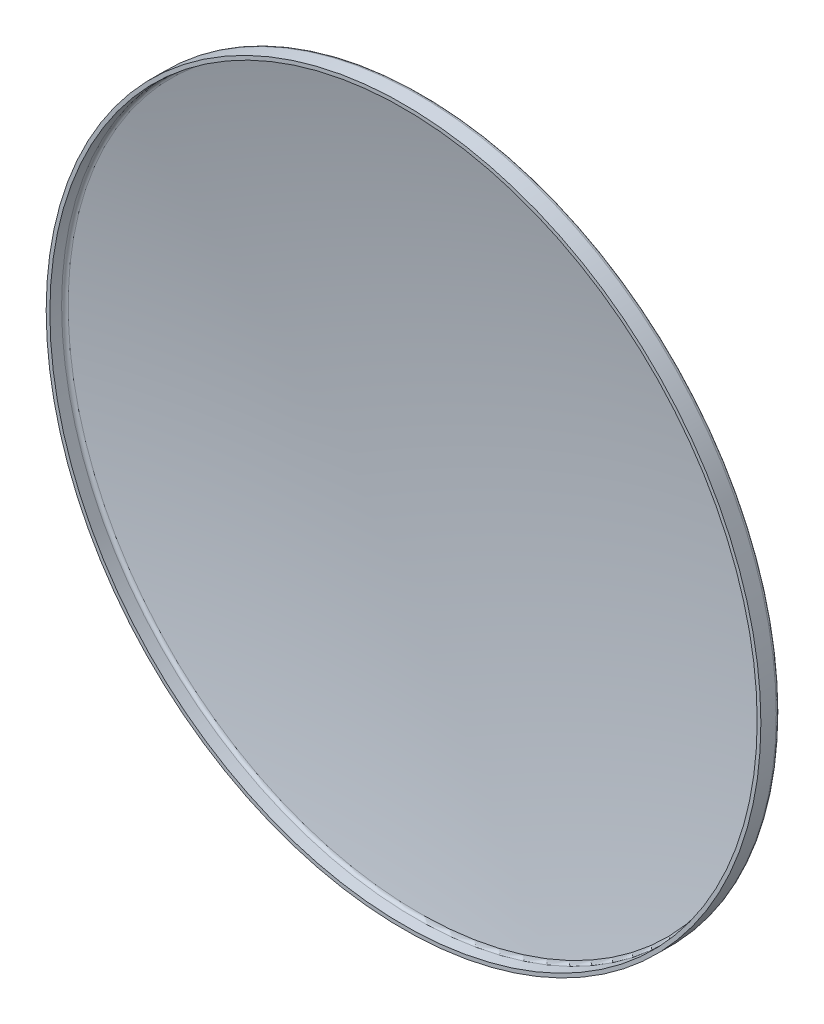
from build123d import *


with BuildPart() as part:
    # Sketch1 → Revolve2 (revolve)
    with BuildSketch(Plane(origin=(0, 0, 0), x_dir=(1, 0, 0), z_dir=(0, 1, 0))):
        with BuildLine():
            Line((0, 71.4375), (0, 66.675))
            ThreePointArc((0, 66.675), (227.911459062, 54.936342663), (453.410902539, 19.844602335))
            ThreePointArc((453.410902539, 19.844602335), (456.133256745, 18.186435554), (457.2, 15.1826399))
            Line((457.2, 15.1826399), (457.2, 0))
            Line((457.2, 0), (461.9625, 0))
            Line((461.9625, 0), (461.9625, 19.944381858))
            ThreePointArc((461.9625, 19.944381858), (460.895470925, 22.94852914), (458.172515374, 24.606529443))
            ThreePointArc((458.172515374, 24.606529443), (230.302500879, 59.921174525), (0, 71.4375))
        make_face()
    revolve(axis=Axis((0, 0, 0), (0, 0, -1)))


solid = part.part
